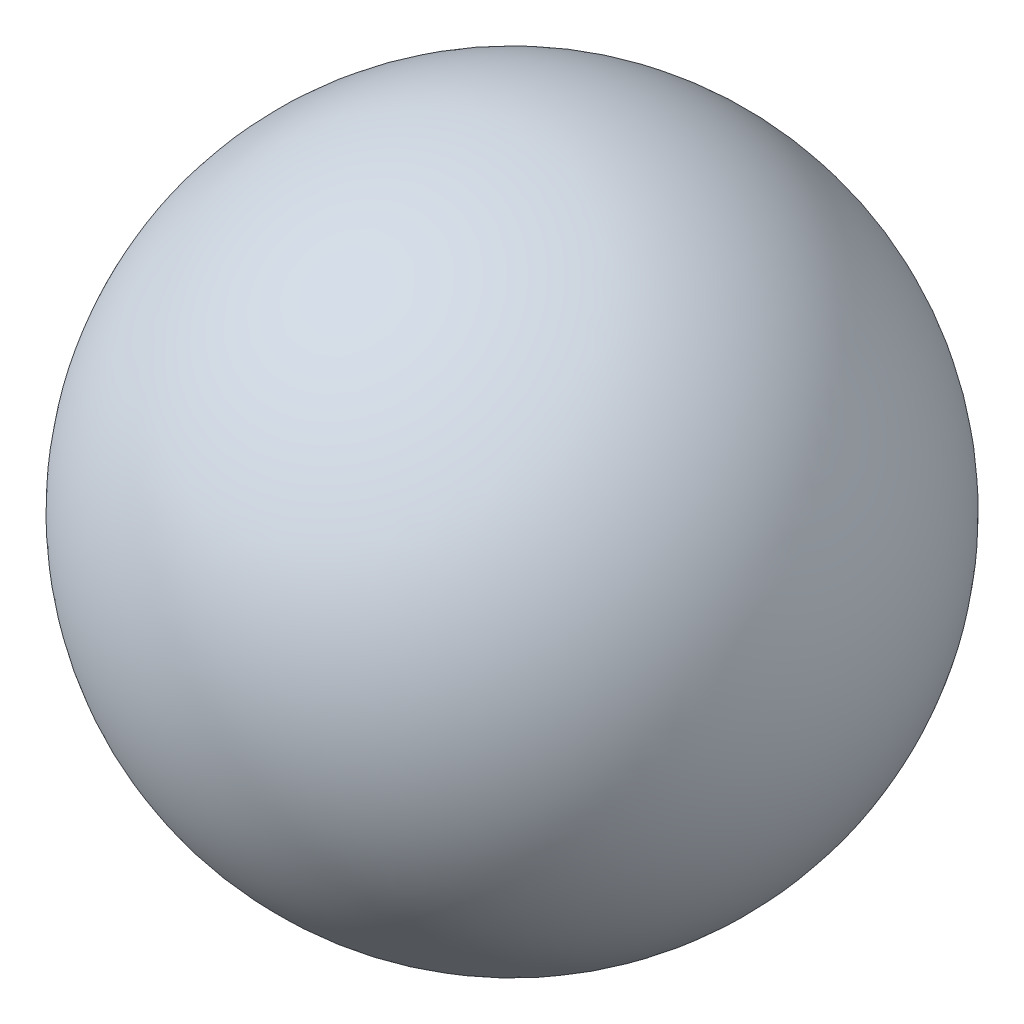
ISO-10303-21;
HEADER;
FILE_DESCRIPTION(('STEP AP214'),'2;1');
FILE_NAME('part.step','',(''),(''),'','','');
FILE_SCHEMA(('AUTOMOTIVE_DESIGN { 1 0 10303 214 1 1 1 1 }'));
ENDSEC;
DATA;
#1=APPLICATION_CONTEXT('core data for automotive mechanical design processes');
#2=APPLICATION_PROTOCOL_DEFINITION('international standard','automotive_design',2000,#1);
#3=PRODUCT_CONTEXT('',#1,'mechanical');
#4=PRODUCT('Part','Part','',(#3));
#5=PRODUCT_RELATED_PRODUCT_CATEGORY('part','',(#4));
#6=PRODUCT_DEFINITION_FORMATION('','',#4);
#7=PRODUCT_DEFINITION_CONTEXT('part definition',#1,'design');
#8=PRODUCT_DEFINITION('design','',#6,#7);
#9=PRODUCT_DEFINITION_SHAPE('','',#8);
#10=(LENGTH_UNIT() NAMED_UNIT(*) SI_UNIT(.MILLI.,.METRE.));
#11=(NAMED_UNIT(*) PLANE_ANGLE_UNIT() SI_UNIT($,.RADIAN.));
#12=(NAMED_UNIT(*) SI_UNIT($,.STERADIAN.) SOLID_ANGLE_UNIT());
#13=UNCERTAINTY_MEASURE_WITH_UNIT(LENGTH_MEASURE(1.E-05),#10,'distance_accuracy_value','');
#14=(GEOMETRIC_REPRESENTATION_CONTEXT(3) GLOBAL_UNCERTAINTY_ASSIGNED_CONTEXT((#13)) GLOBAL_UNIT_ASSIGNED_CONTEXT((#10,
#11,#12)) REPRESENTATION_CONTEXT('',''));
#15=CARTESIAN_POINT('',(0.,0.,0.));
#16=DIRECTION('',(0.,0.,1.));
#17=DIRECTION('',(1.,0.,0.));
#18=AXIS2_PLACEMENT_3D('',#15,#16,#17);
#19=CARTESIAN_POINT('',(0.,-7.9375,0.));
#20=DIRECTION('',(1.,0.,0.));
#21=DIRECTION('',(0.,-1.,0.));
#22=AXIS2_PLACEMENT_3D('',#19,#20,#21);
#23=SPHERICAL_SURFACE('',#22,1.72035132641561);
#24=CARTESIAN_POINT('',(-1.72035132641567,-7.9375,0.));
#25=VERTEX_POINT('',#24);
#26=VERTEX_LOOP('',#25);
#27=FACE_BOUND('',#26,.T.);
#28=ADVANCED_FACE('F15',(#27),#23,.T.);
#29=CLOSED_SHELL('',(#28));
#30=MANIFOLD_SOLID_BREP('B1',#29);
#31=ADVANCED_BREP_SHAPE_REPRESENTATION('',(#18,#30),#14);
#32=SHAPE_DEFINITION_REPRESENTATION(#9,#31);
ENDSEC;
END-ISO-10303-21;
